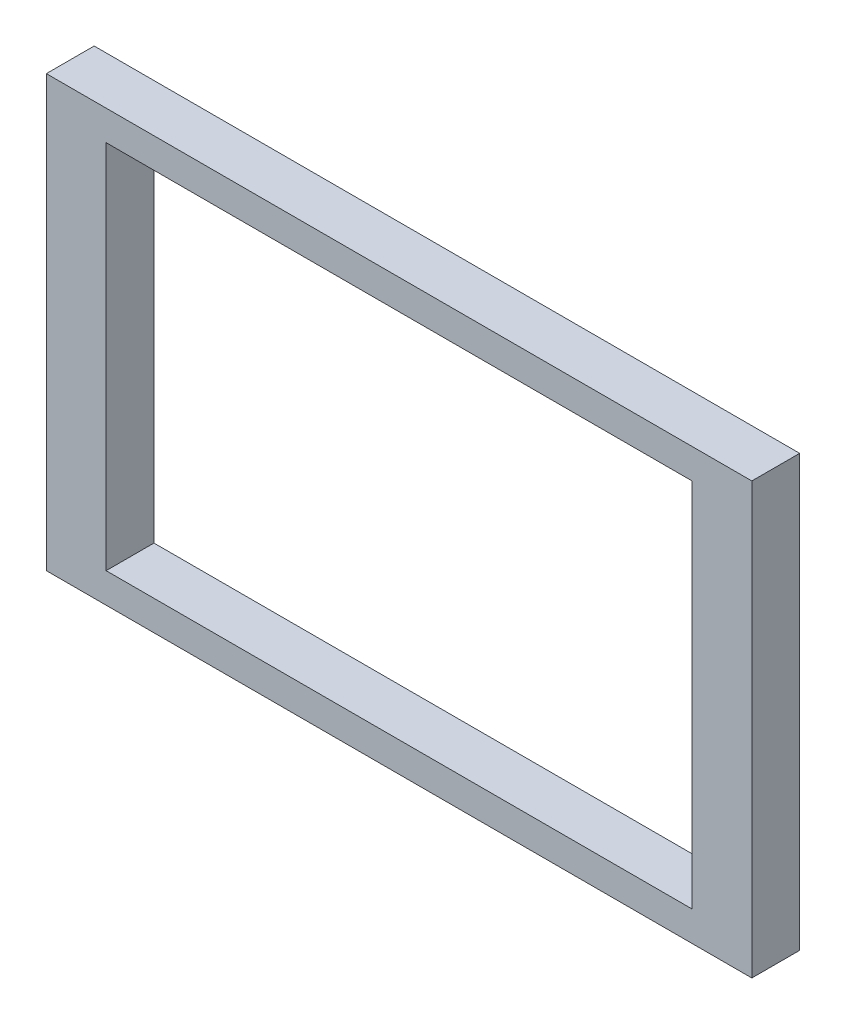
from build123d import *

# Parameters (mm, degrees)
ESQUISSE1_W             = 59
ESQUISSE1_H             = 36
EXTRUSION1_DEPTH        = 4
ENL_V_MAT_EXTRU_1_REACH = 71.231
ESQUISSE2_W             = 49
ESQUISSE2_H             = 31


with BuildPart() as part:
    # Esquisse1 → Extrusion1 (new body)
    with BuildSketch(Plane.XY):
        with Locations((29.5, 18)):
            Rectangle(ESQUISSE1_W, ESQUISSE1_H)
    extrude(amount=EXTRUSION1_DEPTH)

    # Esquisse2 → Enl_v. mat.-Extru.1 (cut, up to next)
    with BuildSketch(Plane.XY.offset(4), mode=Mode.PRIVATE) as enl_v_mat_extru_1_sk1:
        with Locations((29.5, 18)):
            Rectangle(ESQUISSE2_W, ESQUISSE2_H)
    enl_v_mat_extru_1_tool1 = extrude(enl_v_mat_extru_1_sk1.sketch, amount=-ENL_V_MAT_EXTRU_1_REACH, mode=Mode.PRIVATE) & part.part
    add(enl_v_mat_extru_1_tool1.solids().sort_by_distance((29.5, 18, 4))[0], mode=Mode.SUBTRACT)


solid = part.part
